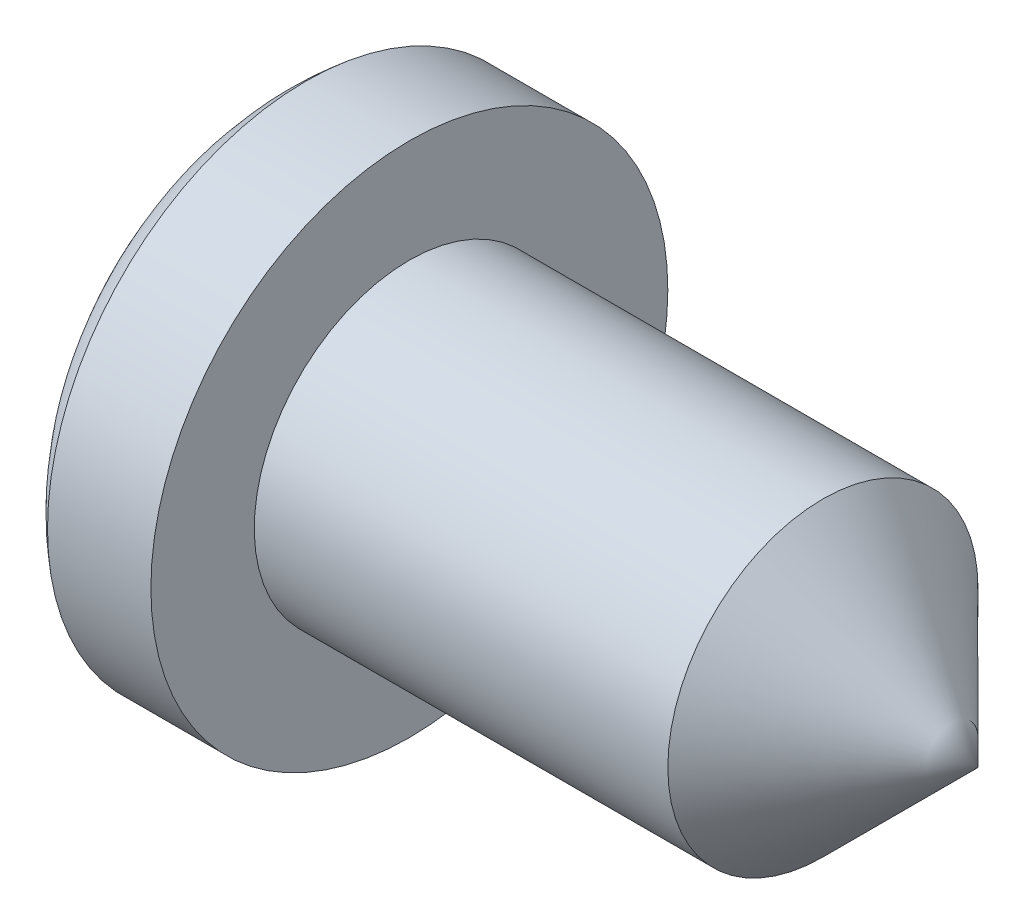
from build123d import *

# Parameters (mm, degrees)
ENL_V_MAT_EXTRU_3_DEPTH      = 0.2
R_P_TITION_CIRCULAIRE1_COUNT = 2
R_P_TITION_CIRCULAIRE1_ANGLE = 90


with BuildPart() as part:
    # Esquisse1 → R_volution8 (revolve)
    with BuildSketch(Plane.XY):
        with BuildLine():
            Line((15.943642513, 28.466049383), (16.943642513, 28.466049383))
            Line((16.943642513, 28.466049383), (16.943642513, 27.466049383))
            Line((16.943642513, 27.466049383), (20.943642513, 27.466049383))
            Line((20.943642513, 27.466049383), (22.443642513, 25.966049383))
            Line((22.443642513, 25.966049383), (15.443642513, 25.966049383))
            ThreePointArc((15.443642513, 25.966049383), (15.243657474, 27.306046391), (15.943642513, 28.466049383))
        make_face()
    revolve(axis=Axis((22.443642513, 25.966049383, 0), (-1, 0, 0)))

    # Esquisse6 → Enl_v. mat.-Extru.3 (cut, symmetric)
    with BuildSketch(Plane.XY):
        Polygon((14.324631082, 28.033208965), (16.243642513, 26.114197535), (16.243642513, 25.817901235), (14.324631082, 23.898889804), align=None)
    enl_v_mat_extru_3 = extrude(amount=ENL_V_MAT_EXTRU_3_DEPTH, both=True, mode=Mode.SUBTRACT)

    # R_p_tition circulaire1: Enl_v. mat.-Extru.3 ×2 about axis
    r_p_tition_circulaire1_axis = Axis((0, 25.966049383, 0), (-1, 0, 0))
    for i in range(1, R_P_TITION_CIRCULAIRE1_COUNT):
        add(enl_v_mat_extru_3.rotate(r_p_tition_circulaire1_axis, i * R_P_TITION_CIRCULAIRE1_ANGLE / (R_P_TITION_CIRCULAIRE1_COUNT - 1)), mode=Mode.SUBTRACT)


solid = part.part
